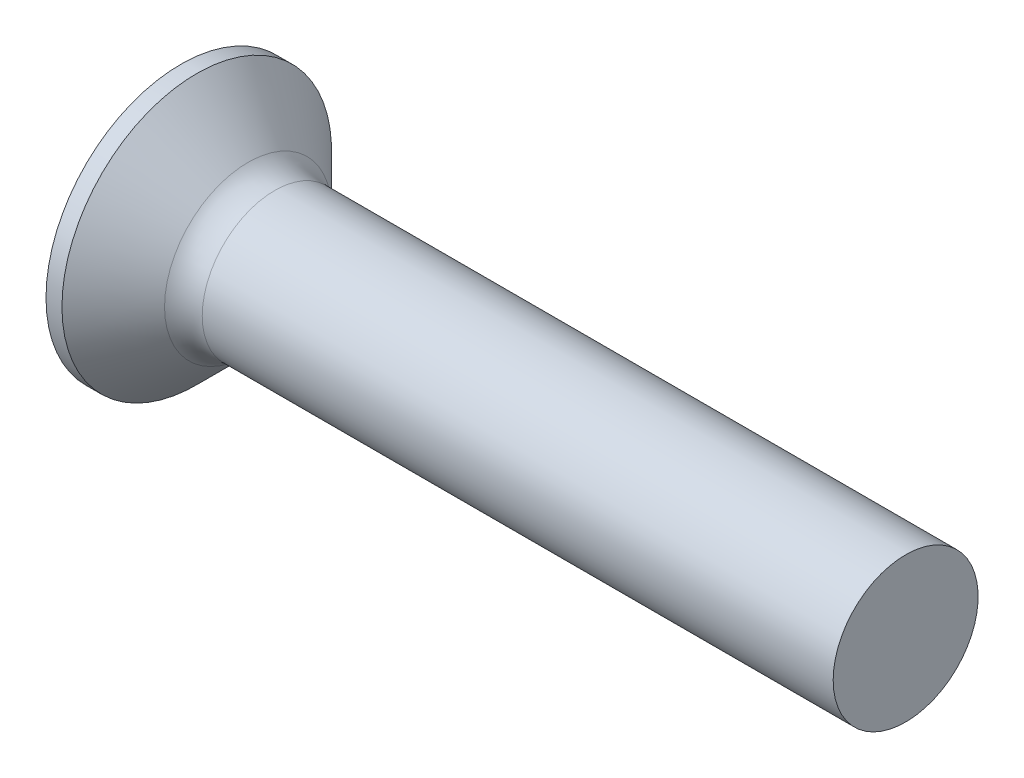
ISO-10303-21;
HEADER;
FILE_DESCRIPTION(('STEP AP214'),'2;1');
FILE_NAME('part.step','',(''),(''),'','','');
FILE_SCHEMA(('AUTOMOTIVE_DESIGN { 1 0 10303 214 1 1 1 1 }'));
ENDSEC;
DATA;
#1=APPLICATION_CONTEXT('core data for automotive mechanical design processes');
#2=APPLICATION_PROTOCOL_DEFINITION('international standard','automotive_design',2000,#1);
#3=PRODUCT_CONTEXT('',#1,'mechanical');
#4=PRODUCT('Part','Part','',(#3));
#5=PRODUCT_RELATED_PRODUCT_CATEGORY('part','',(#4));
#6=PRODUCT_DEFINITION_FORMATION('','',#4);
#7=PRODUCT_DEFINITION_CONTEXT('part definition',#1,'design');
#8=PRODUCT_DEFINITION('design','',#6,#7);
#9=PRODUCT_DEFINITION_SHAPE('','',#8);
#10=(LENGTH_UNIT() NAMED_UNIT(*) SI_UNIT(.MILLI.,.METRE.));
#11=(NAMED_UNIT(*) PLANE_ANGLE_UNIT() SI_UNIT($,.RADIAN.));
#12=(NAMED_UNIT(*) SI_UNIT($,.STERADIAN.) SOLID_ANGLE_UNIT());
#13=UNCERTAINTY_MEASURE_WITH_UNIT(LENGTH_MEASURE(1.E-05),#10,'distance_accuracy_value','');
#14=(GEOMETRIC_REPRESENTATION_CONTEXT(3) GLOBAL_UNCERTAINTY_ASSIGNED_CONTEXT((#13)) GLOBAL_UNIT_ASSIGNED_CONTEXT((#10,
#11,#12)) REPRESENTATION_CONTEXT('',''));
#15=CARTESIAN_POINT('',(0.,0.,0.));
#16=DIRECTION('',(0.,0.,1.));
#17=DIRECTION('',(1.,0.,0.));
#18=AXIS2_PLACEMENT_3D('',#15,#16,#17);
#19=CARTESIAN_POINT('',(3.05,-0.929326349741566,0.515));
#20=DIRECTION('',(0.,0.,-1.));
#21=DIRECTION('',(0.,1.,0.));
#22=AXIS2_PLACEMENT_3D('',#19,#20,#21);
#23=PLANE('',#22);
#24=DIRECTION('',(0.,-1.,0.));
#25=VECTOR('',#24,1.);
#26=CARTESIAN_POINT('',(0.,2.45,0.515));
#27=LINE('',#26,#25);
#28=CARTESIAN_POINT('',(0.,-0.931375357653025,0.515));
#29=VERTEX_POINT('',#28);
#30=CARTESIAN_POINT('',(0.,-2.45,0.515));
#31=VERTEX_POINT('',#30);
#32=EDGE_CURVE('E303',#29,#31,#27,.T.);
#33=ORIENTED_EDGE('',*,*,#32,.F.);
#34=CARTESIAN_POINT('',(-1.54221347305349,-1.05291860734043,0.515));
#35=CARTESIAN_POINT('',(-1.22007147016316,-1.02783607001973,0.515));
#36=CARTESIAN_POINT('',(-0.897941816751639,-1.002592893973,0.515));
#37=CARTESIAN_POINT('',(-0.253713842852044,-0.951673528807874,0.515));
#38=CARTESIAN_POINT('',(0.0683844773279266,-0.925997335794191,0.515));
#39=CARTESIAN_POINT('',(0.712537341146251,-0.874100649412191,0.515));
#40=CARTESIAN_POINT('',(1.03459188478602,-0.847880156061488,0.515));
#41=CARTESIAN_POINT('',(1.67864013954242,-0.794723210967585,0.515));
#42=CARTESIAN_POINT('',(2.0006338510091,-0.767786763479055,0.515));
#43=CARTESIAN_POINT('',(2.56056239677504,-0.720091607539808,0.515));
#44=CARTESIAN_POINT('',(2.7985160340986,-0.699554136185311,0.515));
#45=CARTESIAN_POINT('',(3.27436149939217,-0.657782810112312,0.515));
#46=CARTESIAN_POINT('',(3.51225332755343,-0.636548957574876,0.515));
#47=CARTESIAN_POINT('',(3.98796007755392,-0.59316517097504,0.515));
#48=CARTESIAN_POINT('',(4.22577499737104,-0.571015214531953,0.515));
#49=CARTESIAN_POINT('',(4.70127802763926,-0.525368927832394,0.515));
#50=CARTESIAN_POINT('',(4.93896613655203,-0.50187258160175,0.515000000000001));
#51=CARTESIAN_POINT('',(5.17656597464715,-0.477487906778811,0.515));
#52=B_SPLINE_CURVE_WITH_KNOTS('',3,(#34,#35,#36,#37,#38,#39,#40,#41,#42,#43,#44,#45,#46,#47,#48,
#49,#50,#51),.UNSPECIFIED.,.F.,.F.,(4,2,2,2,2,2,2,2,4),(0.,0.9693512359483,1.9387111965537,
2.90807112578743,3.87742529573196,4.59393929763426,5.3104510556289,6.0269803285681,
6.74351810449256),.UNSPECIFIED.);
#53=CARTESIAN_POINT('',(3.05,-0.677477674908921,0.515));
#54=VERTEX_POINT('',#53);
#55=EDGE_CURVE('E190',#29,#54,#52,.T.);
#56=ORIENTED_EDGE('',*,*,#55,.T.);
#57=DIRECTION('',(0.,-1.,0.));
#58=VECTOR('',#57,1.);
#59=CARTESIAN_POINT('',(3.05,0.929326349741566,0.515));
#60=LINE('',#59,#58);
#61=CARTESIAN_POINT('',(3.05,-0.929326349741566,0.515));
#62=VERTEX_POINT('',#61);
#63=EDGE_CURVE('E327',#54,#62,#60,.T.);
#64=ORIENTED_EDGE('',*,*,#63,.T.);
#65=DIRECTION('',(0.894934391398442,0.446197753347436,0.));
#66=VECTOR('',#65,1.);
#67=CARTESIAN_POINT('',(0.,-2.45,0.515));
#68=LINE('',#67,#66);
#69=EDGE_CURVE('E314',#31,#62,#68,.T.);
#70=ORIENTED_EDGE('',*,*,#69,.F.);
#71=EDGE_LOOP('',(#33,#56,#64,#70));
#72=FACE_BOUND('',#71,.T.);
#73=ADVANCED_FACE('F34',(#72),#23,.T.);
#74=CARTESIAN_POINT('',(3.05,0.929326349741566,0.515));
#75=VERTEX_POINT('',#74);
#76=CARTESIAN_POINT('',(3.05,0.677477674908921,0.515));
#77=VERTEX_POINT('',#76);
#78=EDGE_CURVE('E329',#75,#77,#60,.T.);
#79=ORIENTED_EDGE('',*,*,#78,.T.);
#80=CARTESIAN_POINT('',(-1.54221347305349,1.05291860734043,0.515));
#81=CARTESIAN_POINT('',(-1.22007147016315,1.02783607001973,0.515));
#82=CARTESIAN_POINT('',(-0.897941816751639,1.002592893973,0.515));
#83=CARTESIAN_POINT('',(-0.253713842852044,0.951673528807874,0.515));
#84=CARTESIAN_POINT('',(0.0683844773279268,0.925997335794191,0.515));
#85=CARTESIAN_POINT('',(0.712537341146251,0.874100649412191,0.515));
#86=CARTESIAN_POINT('',(1.03459188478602,0.847880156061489,0.515));
#87=CARTESIAN_POINT('',(1.67864013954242,0.794723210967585,0.515));
#88=CARTESIAN_POINT('',(2.0006338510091,0.767786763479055,0.515));
#89=CARTESIAN_POINT('',(2.56056239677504,0.720091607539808,0.515));
#90=CARTESIAN_POINT('',(2.7985160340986,0.699554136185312,0.515));
#91=CARTESIAN_POINT('',(3.27436149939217,0.657782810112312,0.515));
#92=CARTESIAN_POINT('',(3.51225332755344,0.636548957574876,0.515));
#93=CARTESIAN_POINT('',(3.98796007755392,0.593165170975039,0.515));
#94=CARTESIAN_POINT('',(4.22577499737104,0.571015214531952,0.515));
#95=CARTESIAN_POINT('',(4.70127802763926,0.525368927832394,0.515));
#96=CARTESIAN_POINT('',(4.93896613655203,0.50187258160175,0.515));
#97=CARTESIAN_POINT('',(5.17656597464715,0.477487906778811,0.515));
#98=B_SPLINE_CURVE_WITH_KNOTS('',3,(#80,#81,#82,#83,#84,#85,#86,#87,#88,#89,#90,#91,#92,#93,#94,
#95,#96,#97),.UNSPECIFIED.,.F.,.F.,(4,2,2,2,2,2,2,2,4),(0.,0.9693512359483,1.9387111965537,
2.90807112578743,3.87742529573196,4.59393929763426,5.3104510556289,6.0269803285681,
6.74351810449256),.UNSPECIFIED.);
#99=CARTESIAN_POINT('',(0.,0.931375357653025,0.515));
#100=VERTEX_POINT('',#99);
#101=EDGE_CURVE('E184',#77,#100,#98,.F.);
#102=ORIENTED_EDGE('',*,*,#101,.T.);
#103=CARTESIAN_POINT('',(0.,2.45,0.515));
#104=VERTEX_POINT('',#103);
#105=EDGE_CURVE('E305',#104,#100,#27,.T.);
#106=ORIENTED_EDGE('',*,*,#105,.F.);
#107=DIRECTION('',(0.894934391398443,-0.446197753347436,0.));
#108=VECTOR('',#107,1.);
#109=CARTESIAN_POINT('',(0.,2.45,0.515));
#110=LINE('',#109,#108);
#111=EDGE_CURVE('E62',#104,#75,#110,.T.);
#112=ORIENTED_EDGE('',*,*,#111,.T.);
#113=EDGE_LOOP('',(#79,#102,#106,#112));
#114=FACE_BOUND('',#113,.T.);
#115=ADVANCED_FACE('F166',(#114),#23,.T.);
#116=CARTESIAN_POINT('',(3.05,0.929326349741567,-0.515));
#117=DIRECTION('',(0.,0.,1.));
#118=DIRECTION('',(1.,0.,0.));
#119=AXIS2_PLACEMENT_3D('',#116,#117,#118);
#120=PLANE('',#119);
#121=DIRECTION('',(0.,1.,0.));
#122=VECTOR('',#121,1.);
#123=CARTESIAN_POINT('',(3.05,-0.929326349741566,-0.515));
#124=LINE('',#123,#122);
#125=CARTESIAN_POINT('',(3.05,-0.929326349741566,-0.515));
#126=VERTEX_POINT('',#125);
#127=CARTESIAN_POINT('',(3.05,-0.677477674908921,-0.515));
#128=VERTEX_POINT('',#127);
#129=EDGE_CURVE('E328',#126,#128,#124,.T.);
#130=ORIENTED_EDGE('',*,*,#129,.T.);
#131=CARTESIAN_POINT('',(-1.54221347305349,-1.05291860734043,-0.514999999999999));
#132=CARTESIAN_POINT('',(-1.22007147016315,-1.02783607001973,-0.514999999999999));
#133=CARTESIAN_POINT('',(-0.897941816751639,-1.002592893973,-0.514999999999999));
#134=CARTESIAN_POINT('',(-0.253713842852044,-0.951673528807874,-0.514999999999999));
#135=CARTESIAN_POINT('',(0.0683844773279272,-0.925997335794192,-0.514999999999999));
#136=CARTESIAN_POINT('',(0.712537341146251,-0.874100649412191,-0.515));
#137=CARTESIAN_POINT('',(1.03459188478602,-0.847880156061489,-0.515));
#138=CARTESIAN_POINT('',(1.67864013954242,-0.794723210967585,-0.515));
#139=CARTESIAN_POINT('',(2.0006338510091,-0.767786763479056,-0.515));
#140=CARTESIAN_POINT('',(2.56056239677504,-0.720091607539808,-0.515));
#141=CARTESIAN_POINT('',(2.7985160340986,-0.699554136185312,-0.515));
#142=CARTESIAN_POINT('',(3.27436149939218,-0.657782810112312,-0.515));
#143=CARTESIAN_POINT('',(3.51225332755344,-0.636548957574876,-0.515));
#144=CARTESIAN_POINT('',(3.98796007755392,-0.593165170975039,-0.515));
#145=CARTESIAN_POINT('',(4.22577499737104,-0.571015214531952,-0.515));
#146=CARTESIAN_POINT('',(4.70127802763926,-0.525368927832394,-0.515));
#147=CARTESIAN_POINT('',(4.93896613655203,-0.50187258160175,-0.515));
#148=CARTESIAN_POINT('',(5.17656597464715,-0.477487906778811,-0.515));
#149=B_SPLINE_CURVE_WITH_KNOTS('',3,(#131,#132,#133,#134,#135,#136,#137,#138,#139,#140,#141,
#142,#143,#144,#145,#146,#147,#148),.UNSPECIFIED.,.F.,.F.,(4,2,2,2,2,2,2,2,4),(0.,
0.9693512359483,1.9387111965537,2.90807112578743,3.87742529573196,4.59393929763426,
5.3104510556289,6.0269803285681,6.74351810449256),.UNSPECIFIED.);
#150=CARTESIAN_POINT('',(0.,-0.931375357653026,-0.514999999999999));
#151=VERTEX_POINT('',#150);
#152=EDGE_CURVE('E231',#128,#151,#149,.F.);
#153=ORIENTED_EDGE('',*,*,#152,.T.);
#154=DIRECTION('',(0.,1.,0.));
#155=VECTOR('',#154,1.);
#156=CARTESIAN_POINT('',(0.,-2.45,-0.514999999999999));
#157=LINE('',#156,#155);
#158=CARTESIAN_POINT('',(0.,-2.45,-0.514999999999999));
#159=VERTEX_POINT('',#158);
#160=EDGE_CURVE('E304',#159,#151,#157,.T.);
#161=ORIENTED_EDGE('',*,*,#160,.F.);
#162=DIRECTION('',(0.894934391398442,0.446197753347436,0.));
#163=VECTOR('',#162,1.);
#164=CARTESIAN_POINT('',(0.,-2.45,-0.514999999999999));
#165=LINE('',#164,#163);
#166=EDGE_CURVE('E317',#159,#126,#165,.T.);
#167=ORIENTED_EDGE('',*,*,#166,.T.);
#168=EDGE_LOOP('',(#130,#153,#161,#167));
#169=FACE_BOUND('',#168,.T.);
#170=ADVANCED_FACE('F172',(#169),#120,.T.);
#171=CARTESIAN_POINT('',(0.,0.931375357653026,-0.514999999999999));
#172=VERTEX_POINT('',#171);
#173=CARTESIAN_POINT('',(0.,2.45,-0.514999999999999));
#174=VERTEX_POINT('',#173);
#175=EDGE_CURVE('E313',#172,#174,#157,.T.);
#176=ORIENTED_EDGE('',*,*,#175,.F.);
#177=CARTESIAN_POINT('',(-1.54221347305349,1.05291860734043,-0.514999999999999));
#178=CARTESIAN_POINT('',(-1.22007147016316,1.02783607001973,-0.514999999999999));
#179=CARTESIAN_POINT('',(-0.897941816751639,1.002592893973,-0.514999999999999));
#180=CARTESIAN_POINT('',(-0.253713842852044,0.951673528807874,-0.514999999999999));
#181=CARTESIAN_POINT('',(0.0683844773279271,0.925997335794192,-0.514999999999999));
#182=CARTESIAN_POINT('',(0.712537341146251,0.874100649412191,-0.515));
#183=CARTESIAN_POINT('',(1.03459188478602,0.847880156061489,-0.515));
#184=CARTESIAN_POINT('',(1.67864013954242,0.794723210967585,-0.515));
#185=CARTESIAN_POINT('',(2.0006338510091,0.767786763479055,-0.515));
#186=CARTESIAN_POINT('',(2.56056239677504,0.720091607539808,-0.515));
#187=CARTESIAN_POINT('',(2.7985160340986,0.699554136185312,-0.515));
#188=CARTESIAN_POINT('',(3.27436149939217,0.657782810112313,-0.515));
#189=CARTESIAN_POINT('',(3.51225332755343,0.636548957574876,-0.515));
#190=CARTESIAN_POINT('',(3.98796007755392,0.59316517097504,-0.515));
#191=CARTESIAN_POINT('',(4.22577499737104,0.571015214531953,-0.515));
#192=CARTESIAN_POINT('',(4.70127802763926,0.525368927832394,-0.515));
#193=CARTESIAN_POINT('',(4.93896613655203,0.50187258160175,-0.515));
#194=CARTESIAN_POINT('',(5.17656597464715,0.477487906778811,-0.515));
#195=B_SPLINE_CURVE_WITH_KNOTS('',3,(#177,#178,#179,#180,#181,#182,#183,#184,#185,#186,#187,
#188,#189,#190,#191,#192,#193,#194),.UNSPECIFIED.,.F.,.F.,(4,2,2,2,2,2,2,2,4),(0.,
0.9693512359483,1.9387111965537,2.90807112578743,3.87742529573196,4.59393929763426,
5.3104510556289,6.0269803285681,6.74351810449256),.UNSPECIFIED.);
#196=CARTESIAN_POINT('',(3.05,0.677477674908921,-0.515));
#197=VERTEX_POINT('',#196);
#198=EDGE_CURVE('E227',#172,#197,#195,.T.);
#199=ORIENTED_EDGE('',*,*,#198,.T.);
#200=CARTESIAN_POINT('',(3.05,0.929326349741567,-0.515));
#201=VERTEX_POINT('',#200);
#202=EDGE_CURVE('E334',#197,#201,#124,.T.);
#203=ORIENTED_EDGE('',*,*,#202,.T.);
#204=DIRECTION('',(0.894934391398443,-0.446197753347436,0.));
#205=VECTOR('',#204,1.);
#206=CARTESIAN_POINT('',(0.,2.45,-0.514999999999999));
#207=LINE('',#206,#205);
#208=EDGE_CURVE('E321',#174,#201,#207,.T.);
#209=ORIENTED_EDGE('',*,*,#208,.F.);
#210=EDGE_LOOP('',(#176,#199,#203,#209));
#211=FACE_BOUND('',#210,.T.);
#212=ADVANCED_FACE('F452',(#211),#120,.T.);
#213=CARTESIAN_POINT('',(3.05,-0.929326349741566,-0.515));
#214=DIRECTION('',(-1.,0.,0.));
#215=DIRECTION('',(0.,0.,1.));
#216=AXIS2_PLACEMENT_3D('',#213,#214,#215);
#217=PLANE('',#216);
#218=ORIENTED_EDGE('',*,*,#63,.F.);
#219=CARTESIAN_POINT('',(3.05,0.,0.));
#220=DIRECTION('',(-1.,0.,0.));
#221=DIRECTION('',(0.,0.,1.));
#222=AXIS2_PLACEMENT_3D('',#219,#220,#221);
#223=CIRCLE('',#222,0.850999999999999);
#224=EDGE_CURVE('E274',#128,#54,#223,.T.);
#225=ORIENTED_EDGE('',*,*,#224,.F.);
#226=ORIENTED_EDGE('',*,*,#129,.F.);
#227=DIRECTION('',(0.,0.,-1.));
#228=VECTOR('',#227,1.);
#229=CARTESIAN_POINT('',(3.05,-0.929326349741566,0.515));
#230=LINE('',#229,#228);
#231=EDGE_CURVE('E324',#62,#126,#230,.T.);
#232=ORIENTED_EDGE('',*,*,#231,.F.);
#233=EDGE_LOOP('',(#218,#225,#226,#232));
#234=FACE_BOUND('',#233,.T.);
#235=ADVANCED_FACE('F445',(#234),#217,.T.);
#236=DIRECTION('',(0.,0.,-1.));
#237=VECTOR('',#236,1.);
#238=CARTESIAN_POINT('',(3.05,-0.515000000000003,0.929326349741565));
#239=LINE('',#238,#237);
#240=CARTESIAN_POINT('',(3.05,-0.514999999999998,-0.677477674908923));
#241=VERTEX_POINT('',#240);
#242=CARTESIAN_POINT('',(3.05,-0.514999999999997,-0.929326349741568));
#243=VERTEX_POINT('',#242);
#244=EDGE_CURVE('E289',#241,#243,#239,.T.);
#245=ORIENTED_EDGE('',*,*,#244,.F.);
#246=CARTESIAN_POINT('',(3.05,0.515000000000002,-0.677477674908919));
#247=VERTEX_POINT('',#246);
#248=EDGE_CURVE('E279',#247,#241,#223,.T.);
#249=ORIENTED_EDGE('',*,*,#248,.F.);
#250=DIRECTION('',(0.,0.,1.));
#251=VECTOR('',#250,1.);
#252=CARTESIAN_POINT('',(3.05,0.515000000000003,-0.929326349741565));
#253=LINE('',#252,#251);
#254=CARTESIAN_POINT('',(3.05,0.515000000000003,-0.929326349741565));
#255=VERTEX_POINT('',#254);
#256=EDGE_CURVE('E287',#255,#247,#253,.T.);
#257=ORIENTED_EDGE('',*,*,#256,.F.);
#258=DIRECTION('',(0.,1.,0.));
#259=VECTOR('',#258,1.);
#260=CARTESIAN_POINT('',(3.05,-0.514999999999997,-0.929326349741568));
#261=LINE('',#260,#259);
#262=EDGE_CURVE('E298',#243,#255,#261,.T.);
#263=ORIENTED_EDGE('',*,*,#262,.F.);
#264=EDGE_LOOP('',(#245,#249,#257,#263));
#265=FACE_BOUND('',#264,.T.);
#266=ADVANCED_FACE('F285',(#265),#217,.T.);
#267=ORIENTED_EDGE('',*,*,#202,.F.);
#268=EDGE_CURVE('E266',#77,#197,#223,.T.);
#269=ORIENTED_EDGE('',*,*,#268,.F.);
#270=ORIENTED_EDGE('',*,*,#78,.F.);
#271=DIRECTION('',(0.,0.,1.));
#272=VECTOR('',#271,1.);
#273=CARTESIAN_POINT('',(3.05,0.929326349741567,-0.515));
#274=LINE('',#273,#272);
#275=EDGE_CURVE('E325',#201,#75,#274,.T.);
#276=ORIENTED_EDGE('',*,*,#275,.F.);
#277=EDGE_LOOP('',(#267,#269,#270,#276));
#278=FACE_BOUND('',#277,.T.);
#279=ADVANCED_FACE('F425',(#278),#217,.T.);
#280=CARTESIAN_POINT('',(3.05,-0.514999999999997,-0.929326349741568));
#281=DIRECTION('',(0.,1.,0.));
#282=DIRECTION('',(0.,0.,1.));
#283=AXIS2_PLACEMENT_3D('',#280,#281,#282);
#284=PLANE('',#283);
#285=DIRECTION('',(0.,0.,-1.));
#286=VECTOR('',#285,1.);
#287=CARTESIAN_POINT('',(0.,-0.515000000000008,2.45));
#288=LINE('',#287,#286);
#289=CARTESIAN_POINT('',(0.,-0.514999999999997,-0.931375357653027));
#290=VERTEX_POINT('',#289);
#291=CARTESIAN_POINT('',(0.,-0.514999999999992,-2.45));
#292=VERTEX_POINT('',#291);
#293=EDGE_CURVE('E378',#290,#292,#288,.T.);
#294=ORIENTED_EDGE('',*,*,#293,.F.);
#295=CARTESIAN_POINT('',(-1.54221347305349,-0.514999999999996,-1.05291860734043));
#296=CARTESIAN_POINT('',(-1.22007147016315,-0.514999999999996,-1.02783607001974));
#297=CARTESIAN_POINT('',(-0.897941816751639,-0.514999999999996,-1.002592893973));
#298=CARTESIAN_POINT('',(-0.253713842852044,-0.514999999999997,-0.951673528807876));
#299=CARTESIAN_POINT('',(0.0683844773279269,-0.514999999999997,-0.925997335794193));
#300=CARTESIAN_POINT('',(0.712537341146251,-0.514999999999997,-0.874100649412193));
#301=CARTESIAN_POINT('',(1.03459188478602,-0.514999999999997,-0.84788015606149));
#302=CARTESIAN_POINT('',(1.67864013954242,-0.514999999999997,-0.794723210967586));
#303=CARTESIAN_POINT('',(2.0006338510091,-0.514999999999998,-0.767786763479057));
#304=CARTESIAN_POINT('',(2.56056239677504,-0.514999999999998,-0.72009160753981));
#305=CARTESIAN_POINT('',(2.7985160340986,-0.514999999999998,-0.699554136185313));
#306=CARTESIAN_POINT('',(3.27436149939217,-0.514999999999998,-0.657782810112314));
#307=CARTESIAN_POINT('',(3.51225332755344,-0.514999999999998,-0.636548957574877));
#308=CARTESIAN_POINT('',(3.98796007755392,-0.514999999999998,-0.593165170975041));
#309=CARTESIAN_POINT('',(4.22577499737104,-0.514999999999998,-0.571015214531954));
#310=CARTESIAN_POINT('',(4.70127802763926,-0.514999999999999,-0.525368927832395));
#311=CARTESIAN_POINT('',(4.93896613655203,-0.514999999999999,-0.501872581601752));
#312=CARTESIAN_POINT('',(5.17656597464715,-0.514999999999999,-0.477487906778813));
#313=B_SPLINE_CURVE_WITH_KNOTS('',3,(#295,#296,#297,#298,#299,#300,#301,#302,#303,#304,#305,
#306,#307,#308,#309,#310,#311,#312),.UNSPECIFIED.,.F.,.F.,(4,2,2,2,2,2,2,2,4),(0.,
0.9693512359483,1.9387111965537,2.90807112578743,3.87742529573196,4.59393929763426,
5.3104510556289,6.0269803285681,6.74351810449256),.UNSPECIFIED.);
#314=EDGE_CURVE('E221',#290,#241,#313,.T.);
#315=ORIENTED_EDGE('',*,*,#314,.T.);
#316=ORIENTED_EDGE('',*,*,#244,.T.);
#317=DIRECTION('',(0.894934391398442,0.,0.446197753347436));
#318=VECTOR('',#317,1.);
#319=CARTESIAN_POINT('',(0.,-0.514999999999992,-2.45));
#320=LINE('',#319,#318);
#321=EDGE_CURVE('E385',#292,#243,#320,.T.);
#322=ORIENTED_EDGE('',*,*,#321,.F.);
#323=EDGE_LOOP('',(#294,#315,#316,#322));
#324=FACE_BOUND('',#323,.T.);
#325=ADVANCED_FACE('F396',(#324),#284,.T.);
#326=CARTESIAN_POINT('',(3.05,0.514999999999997,0.929326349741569));
#327=DIRECTION('',(0.,-1.,0.));
#328=DIRECTION('',(1.,0.,0.));
#329=AXIS2_PLACEMENT_3D('',#326,#327,#328);
#330=PLANE('',#329);
#331=ORIENTED_EDGE('',*,*,#256,.T.);
#332=CARTESIAN_POINT('',(-1.54221347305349,0.515000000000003,-1.05291860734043));
#333=CARTESIAN_POINT('',(-1.22007147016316,0.515000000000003,-1.02783607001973));
#334=CARTESIAN_POINT('',(-0.897941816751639,0.515000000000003,-1.002592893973));
#335=CARTESIAN_POINT('',(-0.253713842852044,0.515000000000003,-0.951673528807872));
#336=CARTESIAN_POINT('',(0.0683844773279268,0.515000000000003,-0.92599733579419));
#337=CARTESIAN_POINT('',(0.712537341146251,0.515000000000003,-0.874100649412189));
#338=CARTESIAN_POINT('',(1.03459188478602,0.515000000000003,-0.847880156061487));
#339=CARTESIAN_POINT('',(1.67864013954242,0.515000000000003,-0.794723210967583));
#340=CARTESIAN_POINT('',(2.0006338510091,0.515000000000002,-0.767786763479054));
#341=CARTESIAN_POINT('',(2.56056239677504,0.515000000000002,-0.720091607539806));
#342=CARTESIAN_POINT('',(2.7985160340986,0.515000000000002,-0.69955413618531));
#343=CARTESIAN_POINT('',(3.27436149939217,0.515000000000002,-0.657782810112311));
#344=CARTESIAN_POINT('',(3.51225332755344,0.515000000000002,-0.636548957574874));
#345=CARTESIAN_POINT('',(3.98796007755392,0.515000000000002,-0.593165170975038));
#346=CARTESIAN_POINT('',(4.22577499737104,0.515000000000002,-0.571015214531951));
#347=CARTESIAN_POINT('',(4.70127802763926,0.515000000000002,-0.525368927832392));
#348=CARTESIAN_POINT('',(4.93896613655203,0.515000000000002,-0.501872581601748));
#349=CARTESIAN_POINT('',(5.17656597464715,0.515000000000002,-0.47748790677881));
#350=B_SPLINE_CURVE_WITH_KNOTS('',3,(#332,#333,#334,#335,#336,#337,#338,#339,#340,#341,#342,
#343,#344,#345,#346,#347,#348,#349),.UNSPECIFIED.,.F.,.F.,(4,2,2,2,2,2,2,2,4),(0.,
0.9693512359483,1.9387111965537,2.90807112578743,3.87742529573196,4.59393929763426,
5.3104510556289,6.0269803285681,6.74351810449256),.UNSPECIFIED.);
#351=CARTESIAN_POINT('',(0.,0.515000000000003,-0.931375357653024));
#352=VERTEX_POINT('',#351);
#353=EDGE_CURVE('E215',#247,#352,#350,.F.);
#354=ORIENTED_EDGE('',*,*,#353,.T.);
#355=DIRECTION('',(0.,0.,1.));
#356=VECTOR('',#355,1.);
#357=CARTESIAN_POINT('',(0.,0.515000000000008,-2.45));
#358=LINE('',#357,#356);
#359=CARTESIAN_POINT('',(0.,0.515000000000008,-2.45));
#360=VERTEX_POINT('',#359);
#361=EDGE_CURVE('E382',#360,#352,#358,.T.);
#362=ORIENTED_EDGE('',*,*,#361,.F.);
#363=DIRECTION('',(0.894934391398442,0.,0.446197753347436));
#364=VECTOR('',#363,1.);
#365=CARTESIAN_POINT('',(0.,0.515000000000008,-2.45));
#366=LINE('',#365,#364);
#367=EDGE_CURVE('E291',#360,#255,#366,.T.);
#368=ORIENTED_EDGE('',*,*,#367,.T.);
#369=EDGE_LOOP('',(#331,#354,#362,#368));
#370=FACE_BOUND('',#369,.T.);
#371=ADVANCED_FACE('F290',(#370),#330,.T.);
#372=CARTESIAN_POINT('',(3.05,-0.515000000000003,0.929326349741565));
#373=VERTEX_POINT('',#372);
#374=CARTESIAN_POINT('',(3.05,-0.515000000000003,0.677477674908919));
#375=VERTEX_POINT('',#374);
#376=EDGE_CURVE('E393',#373,#375,#239,.T.);
#377=ORIENTED_EDGE('',*,*,#376,.T.);
#378=CARTESIAN_POINT('',(-1.54221347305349,-0.515000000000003,1.05291860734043));
#379=CARTESIAN_POINT('',(-1.22007147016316,-0.515000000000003,1.02783607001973));
#380=CARTESIAN_POINT('',(-0.897941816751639,-0.515000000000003,1.002592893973));
#381=CARTESIAN_POINT('',(-0.253713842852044,-0.515000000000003,0.951673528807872));
#382=CARTESIAN_POINT('',(0.0683844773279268,-0.515000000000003,0.92599733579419));
#383=CARTESIAN_POINT('',(0.712537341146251,-0.515000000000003,0.874100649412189));
#384=CARTESIAN_POINT('',(1.03459188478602,-0.515000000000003,0.847880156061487));
#385=CARTESIAN_POINT('',(1.67864013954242,-0.515000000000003,0.794723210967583));
#386=CARTESIAN_POINT('',(2.0006338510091,-0.515000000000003,0.767786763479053));
#387=CARTESIAN_POINT('',(2.56056239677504,-0.515000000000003,0.720091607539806));
#388=CARTESIAN_POINT('',(2.7985160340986,-0.515000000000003,0.69955413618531));
#389=CARTESIAN_POINT('',(3.27436149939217,-0.515000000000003,0.657782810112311));
#390=CARTESIAN_POINT('',(3.51225332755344,-0.515000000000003,0.636548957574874));
#391=CARTESIAN_POINT('',(3.98796007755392,-0.515000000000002,0.593165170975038));
#392=CARTESIAN_POINT('',(4.22577499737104,-0.515000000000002,0.571015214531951));
#393=CARTESIAN_POINT('',(4.70127802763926,-0.515000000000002,0.525368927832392));
#394=CARTESIAN_POINT('',(4.93896613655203,-0.515000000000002,0.501872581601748));
#395=CARTESIAN_POINT('',(5.17656597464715,-0.515000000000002,0.47748790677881));
#396=B_SPLINE_CURVE_WITH_KNOTS('',3,(#378,#379,#380,#381,#382,#383,#384,#385,#386,#387,#388,
#389,#390,#391,#392,#393,#394,#395),.UNSPECIFIED.,.F.,.F.,(4,2,2,2,2,2,2,2,4),(0.,
0.9693512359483,1.9387111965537,2.90807112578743,3.87742529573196,4.59393929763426,
5.3104510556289,6.0269803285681,6.74351810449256),.UNSPECIFIED.);
#397=CARTESIAN_POINT('',(0.,-0.515000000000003,0.931375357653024));
#398=VERTEX_POINT('',#397);
#399=EDGE_CURVE('E208',#375,#398,#396,.F.);
#400=ORIENTED_EDGE('',*,*,#399,.T.);
#401=CARTESIAN_POINT('',(0.,-0.515000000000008,2.45));
#402=VERTEX_POINT('',#401);
#403=EDGE_CURVE('E374',#402,#398,#288,.T.);
#404=ORIENTED_EDGE('',*,*,#403,.F.);
#405=DIRECTION('',(0.894934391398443,0.,-0.446197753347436));
#406=VECTOR('',#405,1.);
#407=CARTESIAN_POINT('',(0.,-0.515000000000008,2.45));
#408=LINE('',#407,#406);
#409=EDGE_CURVE('E389',#402,#373,#408,.T.);
#410=ORIENTED_EDGE('',*,*,#409,.T.);
#411=EDGE_LOOP('',(#377,#400,#404,#410));
#412=FACE_BOUND('',#411,.T.);
#413=ADVANCED_FACE('F421',(#412),#284,.T.);
#414=CARTESIAN_POINT('',(0.,0.514999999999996,0.931375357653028));
#415=VERTEX_POINT('',#414);
#416=CARTESIAN_POINT('',(0.,0.514999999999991,2.45));
#417=VERTEX_POINT('',#416);
#418=EDGE_CURVE('E384',#415,#417,#358,.T.);
#419=ORIENTED_EDGE('',*,*,#418,.F.);
#420=CARTESIAN_POINT('',(-1.54221347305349,0.514999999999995,1.05291860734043));
#421=CARTESIAN_POINT('',(-1.22007147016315,0.514999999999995,1.02783607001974));
#422=CARTESIAN_POINT('',(-0.897941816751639,0.514999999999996,1.002592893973));
#423=CARTESIAN_POINT('',(-0.253713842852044,0.514999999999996,0.951673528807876));
#424=CARTESIAN_POINT('',(0.0683844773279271,0.514999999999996,0.925997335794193));
#425=CARTESIAN_POINT('',(0.712537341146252,0.514999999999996,0.874100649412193));
#426=CARTESIAN_POINT('',(1.03459188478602,0.514999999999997,0.84788015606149));
#427=CARTESIAN_POINT('',(1.67864013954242,0.514999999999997,0.794723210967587));
#428=CARTESIAN_POINT('',(2.0006338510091,0.514999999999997,0.767786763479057));
#429=CARTESIAN_POINT('',(2.56056239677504,0.514999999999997,0.72009160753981));
#430=CARTESIAN_POINT('',(2.7985160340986,0.514999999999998,0.699554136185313));
#431=CARTESIAN_POINT('',(3.27436149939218,0.514999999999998,0.657782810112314));
#432=CARTESIAN_POINT('',(3.51225332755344,0.514999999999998,0.636548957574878));
#433=CARTESIAN_POINT('',(3.98796007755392,0.514999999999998,0.593165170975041));
#434=CARTESIAN_POINT('',(4.22577499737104,0.514999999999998,0.571015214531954));
#435=CARTESIAN_POINT('',(4.70127802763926,0.514999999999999,0.525368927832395));
#436=CARTESIAN_POINT('',(4.93896613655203,0.514999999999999,0.501872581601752));
#437=CARTESIAN_POINT('',(5.17656597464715,0.514999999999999,0.477487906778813));
#438=B_SPLINE_CURVE_WITH_KNOTS('',3,(#420,#421,#422,#423,#424,#425,#426,#427,#428,#429,#430,
#431,#432,#433,#434,#435,#436,#437),.UNSPECIFIED.,.F.,.F.,(4,2,2,2,2,2,2,2,4),(0.,
0.9693512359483,1.9387111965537,2.90807112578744,3.87742529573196,4.59393929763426,
5.3104510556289,6.0269803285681,6.74351810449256),.UNSPECIFIED.);
#439=CARTESIAN_POINT('',(3.05,0.514999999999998,0.677477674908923));
#440=VERTEX_POINT('',#439);
#441=EDGE_CURVE('E11',#415,#440,#438,.T.);
#442=ORIENTED_EDGE('',*,*,#441,.T.);
#443=CARTESIAN_POINT('',(3.05,0.514999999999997,0.929326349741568));
#444=VERTEX_POINT('',#443);
#445=EDGE_CURVE('E196',#440,#444,#253,.T.);
#446=ORIENTED_EDGE('',*,*,#445,.T.);
#447=DIRECTION('',(0.894934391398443,0.,-0.446197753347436));
#448=VECTOR('',#447,1.);
#449=CARTESIAN_POINT('',(0.,0.514999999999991,2.45));
#450=LINE('',#449,#448);
#451=EDGE_CURVE('E391',#417,#444,#450,.T.);
#452=ORIENTED_EDGE('',*,*,#451,.F.);
#453=EDGE_LOOP('',(#419,#442,#446,#452));
#454=FACE_BOUND('',#453,.T.);
#455=ADVANCED_FACE('F372',(#454),#330,.T.);
#456=CARTESIAN_POINT('',(0.,0.,0.));
#457=DIRECTION('',(-1.,0.,0.));
#458=DIRECTION('',(0.,0.,1.));
#459=AXIS2_PLACEMENT_3D('',#456,#457,#458);
#460=PLANE('',#459);
#461=CARTESIAN_POINT('',(0.,0.,0.));
#462=DIRECTION('',(-1.,0.,0.));
#463=DIRECTION('',(0.,0.,1.));
#464=AXIS2_PLACEMENT_3D('',#461,#462,#463);
#465=CIRCLE('',#464,4.65);
#466=CARTESIAN_POINT('',(0.,0.,4.65));
#467=VERTEX_POINT('',#466);
#468=EDGE_CURVE('E340',#467,#467,#465,.T.);
#469=ORIENTED_EDGE('',*,*,#468,.T.);
#470=EDGE_LOOP('',(#469));
#471=FACE_BOUND('',#470,.T.);
#472=ORIENTED_EDGE('',*,*,#403,.T.);
#473=CARTESIAN_POINT('',(0.,0.,0.));
#474=DIRECTION('',(-1.,0.,0.));
#475=DIRECTION('',(0.,0.,1.));
#476=AXIS2_PLACEMENT_3D('',#473,#474,#475);
#477=CIRCLE('',#476,1.06427677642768);
#478=EDGE_CURVE('E260',#29,#398,#477,.T.);
#479=ORIENTED_EDGE('',*,*,#478,.F.);
#480=ORIENTED_EDGE('',*,*,#32,.T.);
#481=DIRECTION('',(0.,0.,-1.));
#482=VECTOR('',#481,1.);
#483=CARTESIAN_POINT('',(0.,-2.45,0.515));
#484=LINE('',#483,#482);
#485=EDGE_CURVE('E308',#31,#159,#484,.T.);
#486=ORIENTED_EDGE('',*,*,#485,.T.);
#487=ORIENTED_EDGE('',*,*,#160,.T.);
#488=EDGE_CURVE('E262',#290,#151,#477,.T.);
#489=ORIENTED_EDGE('',*,*,#488,.F.);
#490=ORIENTED_EDGE('',*,*,#293,.T.);
#491=DIRECTION('',(0.,1.,0.));
#492=VECTOR('',#491,1.);
#493=CARTESIAN_POINT('',(0.,-0.514999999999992,-2.45));
#494=LINE('',#493,#492);
#495=EDGE_CURVE('E377',#292,#360,#494,.T.);
#496=ORIENTED_EDGE('',*,*,#495,.T.);
#497=ORIENTED_EDGE('',*,*,#361,.T.);
#498=EDGE_CURVE('E259',#172,#352,#477,.T.);
#499=ORIENTED_EDGE('',*,*,#498,.F.);
#500=ORIENTED_EDGE('',*,*,#175,.T.);
#501=DIRECTION('',(0.,0.,1.));
#502=VECTOR('',#501,1.);
#503=CARTESIAN_POINT('',(0.,2.45,-0.514999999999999));
#504=LINE('',#503,#502);
#505=EDGE_CURVE('E300',#174,#104,#504,.T.);
#506=ORIENTED_EDGE('',*,*,#505,.T.);
#507=ORIENTED_EDGE('',*,*,#105,.T.);
#508=EDGE_CURVE('E255',#415,#100,#477,.T.);
#509=ORIENTED_EDGE('',*,*,#508,.F.);
#510=ORIENTED_EDGE('',*,*,#418,.T.);
#511=DIRECTION('',(0.,-1.,0.));
#512=VECTOR('',#511,1.);
#513=CARTESIAN_POINT('',(0.,0.514999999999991,2.45));
#514=LINE('',#513,#512);
#515=EDGE_CURVE('E197',#417,#402,#514,.T.);
#516=ORIENTED_EDGE('',*,*,#515,.T.);
#517=EDGE_LOOP('',(#472,#479,#480,#486,#487,#489,#490,#496,#497,#499,#500,#506,#507,#509,#510,#516));
#518=FACE_BOUND('',#517,.T.);
#519=ADVANCED_FACE('F366',(#471,#518),#460,.T.);
#520=CARTESIAN_POINT('',(-6.34999999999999,0.,0.));
#521=DIRECTION('',(-1.,0.,0.));
#522=DIRECTION('',(0.,0.,1.));
#523=AXIS2_PLACEMENT_3D('',#520,#521,#522);
#524=CYLINDRICAL_SURFACE('',#523,4.65);
#525=CARTESIAN_POINT('',(0.550000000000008,0.,0.));
#526=DIRECTION('',(-1.,0.,0.));
#527=DIRECTION('',(0.,0.,1.));
#528=AXIS2_PLACEMENT_3D('',#525,#526,#527);
#529=CIRCLE('',#528,4.65);
#530=CARTESIAN_POINT('',(0.550000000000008,0.,4.65));
#531=VERTEX_POINT('',#530);
#532=EDGE_CURVE('E337',#531,#531,#529,.T.);
#533=ORIENTED_EDGE('',*,*,#532,.T.);
#534=EDGE_LOOP('',(#533));
#535=FACE_BOUND('',#534,.T.);
#536=ORIENTED_EDGE('',*,*,#468,.F.);
#537=EDGE_LOOP('',(#536));
#538=FACE_BOUND('',#537,.T.);
#539=ADVANCED_FACE('F360',(#535,#538),#524,.T.);
#540=CARTESIAN_POINT('',(0.550000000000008,0.,0.));
#541=DIRECTION('',(-1.,0.,0.));
#542=DIRECTION('',(0.,0.,1.));
#543=AXIS2_PLACEMENT_3D('',#540,#541,#542);
#544=CONICAL_SURFACE('',#543,4.65,0.78539816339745);
#545=CARTESIAN_POINT('',(2.31923881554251,0.,0.));
#546=DIRECTION('',(-1.,0.,0.));
#547=DIRECTION('',(0.,0.,1.));
#548=AXIS2_PLACEMENT_3D('',#545,#546,#547);
#549=CIRCLE('',#548,2.88076118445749);
#550=CARTESIAN_POINT('',(2.31923881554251,0.,2.88076118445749));
#551=VERTEX_POINT('',#550);
#552=EDGE_CURVE('E343',#551,#551,#549,.T.);
#553=ORIENTED_EDGE('',*,*,#552,.T.);
#554=EDGE_LOOP('',(#553));
#555=FACE_BOUND('',#554,.T.);
#556=ORIENTED_EDGE('',*,*,#532,.F.);
#557=EDGE_LOOP('',(#556));
#558=FACE_BOUND('',#557,.T.);
#559=ADVANCED_FACE('F357',(#555,#558),#544,.T.);
#560=CARTESIAN_POINT('',(-6.34999999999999,0.,0.));
#561=DIRECTION('',(-1.,0.,0.));
#562=DIRECTION('',(0.,0.,1.));
#563=AXIS2_PLACEMENT_3D('',#560,#561,#562);
#564=CYLINDRICAL_SURFACE('',#563,2.5);
#565=CARTESIAN_POINT('',(3.23847763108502,0.,0.));
#566=DIRECTION('',(-1.,0.,0.));
#567=DIRECTION('',(0.,0.,1.));
#568=AXIS2_PLACEMENT_3D('',#565,#566,#567);
#569=CIRCLE('',#568,2.5);
#570=CARTESIAN_POINT('',(3.23847763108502,0.,2.5));
#571=VERTEX_POINT('',#570);
#572=EDGE_CURVE('E47',#571,#571,#569,.F.);
#573=ORIENTED_EDGE('',*,*,#572,.T.);
#574=EDGE_LOOP('',(#573));
#575=FACE_BOUND('',#574,.T.);
#576=CARTESIAN_POINT('',(25.,0.,0.));
#577=DIRECTION('',(-1.,0.,0.));
#578=DIRECTION('',(0.,0.,1.));
#579=AXIS2_PLACEMENT_3D('',#576,#577,#578);
#580=CIRCLE('',#579,2.5);
#581=CARTESIAN_POINT('',(25.,0.,2.5));
#582=VERTEX_POINT('',#581);
#583=EDGE_CURVE('E311',#582,#582,#580,.T.);
#584=ORIENTED_EDGE('',*,*,#583,.T.);
#585=EDGE_LOOP('',(#584));
#586=FACE_BOUND('',#585,.T.);
#587=ADVANCED_FACE('F348',(#575,#586),#564,.T.);
#588=CARTESIAN_POINT('',(25.,2.5,0.));
#589=DIRECTION('',(1.,0.,0.));
#590=DIRECTION('',(0.,0.,-1.));
#591=AXIS2_PLACEMENT_3D('',#588,#589,#590);
#592=PLANE('',#591);
#593=ORIENTED_EDGE('',*,*,#583,.F.);
#594=EDGE_LOOP('',(#593));
#595=FACE_BOUND('',#594,.T.);
#596=ADVANCED_FACE('F354',(#595),#592,.T.);
#597=CARTESIAN_POINT('',(3.23847763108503,0.,0.));
#598=DIRECTION('',(-1.,0.,0.));
#599=DIRECTION('',(0.,0.,1.));
#600=AXIS2_PLACEMENT_3D('',#597,#598,#599);
#601=TOROIDAL_SURFACE('',#600,3.8,1.3);
#602=ORIENTED_EDGE('',*,*,#572,.F.);
#603=EDGE_LOOP('',(#602));
#604=FACE_BOUND('',#603,.T.);
#605=ORIENTED_EDGE('',*,*,#552,.F.);
#606=EDGE_LOOP('',(#605));
#607=FACE_BOUND('',#606,.T.);
#608=ADVANCED_FACE('F36',(#604,#607),#601,.F.);
#609=ORIENTED_EDGE('',*,*,#445,.F.);
#610=EDGE_CURVE('E267',#375,#440,#223,.T.);
#611=ORIENTED_EDGE('',*,*,#610,.F.);
#612=ORIENTED_EDGE('',*,*,#376,.F.);
#613=DIRECTION('',(0.,-1.,0.));
#614=VECTOR('',#613,1.);
#615=CARTESIAN_POINT('',(3.05,0.514999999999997,0.929326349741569));
#616=LINE('',#615,#614);
#617=EDGE_CURVE('E292',#444,#373,#616,.T.);
#618=ORIENTED_EDGE('',*,*,#617,.F.);
#619=EDGE_LOOP('',(#609,#611,#612,#618));
#620=FACE_BOUND('',#619,.T.);
#621=ADVANCED_FACE('F353',(#620),#217,.T.);
#622=CARTESIAN_POINT('',(3.05,-0.929326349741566,-0.515));
#623=DIRECTION('',(-0.446197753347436,0.894934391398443,0.));
#624=DIRECTION('',(-0.894934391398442,-0.446197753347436,0.));
#625=AXIS2_PLACEMENT_3D('',#622,#623,#624);
#626=PLANE('',#625);
#627=ORIENTED_EDGE('',*,*,#166,.F.);
#628=ORIENTED_EDGE('',*,*,#485,.F.);
#629=ORIENTED_EDGE('',*,*,#69,.T.);
#630=ORIENTED_EDGE('',*,*,#231,.T.);
#631=EDGE_LOOP('',(#627,#628,#629,#630));
#632=FACE_BOUND('',#631,.T.);
#633=ADVANCED_FACE('F178',(#632),#626,.T.);
#634=CARTESIAN_POINT('',(3.05,0.929326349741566,0.515));
#635=DIRECTION('',(-0.446197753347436,-0.894934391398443,0.));
#636=DIRECTION('',(0.894934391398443,-0.446197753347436,0.));
#637=AXIS2_PLACEMENT_3D('',#634,#635,#636);
#638=PLANE('',#637);
#639=ORIENTED_EDGE('',*,*,#111,.F.);
#640=ORIENTED_EDGE('',*,*,#505,.F.);
#641=ORIENTED_EDGE('',*,*,#208,.T.);
#642=ORIENTED_EDGE('',*,*,#275,.T.);
#643=EDGE_LOOP('',(#639,#640,#641,#642));
#644=FACE_BOUND('',#643,.T.);
#645=ADVANCED_FACE('F418',(#644),#638,.T.);
#646=CARTESIAN_POINT('',(3.05,0.515000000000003,-0.929326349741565));
#647=DIRECTION('',(-0.446197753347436,0.,0.894934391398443));
#648=DIRECTION('',(-0.894934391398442,0.,-0.446197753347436));
#649=AXIS2_PLACEMENT_3D('',#646,#647,#648);
#650=PLANE('',#649);
#651=ORIENTED_EDGE('',*,*,#367,.F.);
#652=ORIENTED_EDGE('',*,*,#495,.F.);
#653=ORIENTED_EDGE('',*,*,#321,.T.);
#654=ORIENTED_EDGE('',*,*,#262,.T.);
#655=EDGE_LOOP('',(#651,#652,#653,#654));
#656=FACE_BOUND('',#655,.T.);
#657=ADVANCED_FACE('F201',(#656),#650,.T.);
#658=CARTESIAN_POINT('',(3.05,-0.515000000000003,0.929326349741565));
#659=DIRECTION('',(-0.446197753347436,0.,-0.894934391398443));
#660=DIRECTION('',(0.894934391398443,0.,-0.446197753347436));
#661=AXIS2_PLACEMENT_3D('',#658,#659,#660);
#662=PLANE('',#661);
#663=ORIENTED_EDGE('',*,*,#409,.F.);
#664=ORIENTED_EDGE('',*,*,#515,.F.);
#665=ORIENTED_EDGE('',*,*,#451,.T.);
#666=ORIENTED_EDGE('',*,*,#617,.T.);
#667=EDGE_LOOP('',(#663,#664,#665,#666));
#668=FACE_BOUND('',#667,.T.);
#669=ADVANCED_FACE('F410',(#668),#662,.T.);
#670=CARTESIAN_POINT('',(3.05,0.,0.));
#671=DIRECTION('',(-1.,0.,0.));
#672=DIRECTION('',(0.,0.,1.));
#673=AXIS2_PLACEMENT_3D('',#670,#671,#672);
#674=CONICAL_SURFACE('',#673,0.850999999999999,0.0698131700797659);
#675=ORIENTED_EDGE('',*,*,#478,.T.);
#676=ORIENTED_EDGE('',*,*,#399,.F.);
#677=EDGE_CURVE('E271',#54,#375,#223,.T.);
#678=ORIENTED_EDGE('',*,*,#677,.F.);
#679=ORIENTED_EDGE('',*,*,#55,.F.);
#680=EDGE_LOOP('',(#675,#676,#678,#679));
#681=FACE_BOUND('',#680,.T.);
#682=ADVANCED_FACE('F164',(#681),#674,.F.);
#683=EDGE_CURVE('E54',#440,#77,#223,.T.);
#684=ORIENTED_EDGE('',*,*,#683,.F.);
#685=ORIENTED_EDGE('',*,*,#441,.F.);
#686=ORIENTED_EDGE('',*,*,#508,.T.);
#687=ORIENTED_EDGE('',*,*,#101,.F.);
#688=EDGE_LOOP('',(#684,#685,#686,#687));
#689=FACE_BOUND('',#688,.T.);
#690=ADVANCED_FACE('F403',(#689),#674,.F.);
#691=EDGE_CURVE('E276',#241,#128,#223,.T.);
#692=ORIENTED_EDGE('',*,*,#691,.F.);
#693=ORIENTED_EDGE('',*,*,#314,.F.);
#694=ORIENTED_EDGE('',*,*,#488,.T.);
#695=ORIENTED_EDGE('',*,*,#152,.F.);
#696=EDGE_LOOP('',(#692,#693,#694,#695));
#697=FACE_BOUND('',#696,.T.);
#698=ADVANCED_FACE('F162',(#697),#674,.F.);
#699=ORIENTED_EDGE('',*,*,#498,.T.);
#700=ORIENTED_EDGE('',*,*,#353,.F.);
#701=EDGE_CURVE('E270',#197,#247,#223,.T.);
#702=ORIENTED_EDGE('',*,*,#701,.F.);
#703=ORIENTED_EDGE('',*,*,#198,.F.);
#704=EDGE_LOOP('',(#699,#700,#702,#703));
#705=FACE_BOUND('',#704,.T.);
#706=ADVANCED_FACE('F156',(#705),#674,.F.);
#707=CARTESIAN_POINT('',(3.3265066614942,0.,0.));
#708=DIRECTION('',(-1.,0.,0.));
#709=DIRECTION('',(0.,0.,1.));
#710=AXIS2_PLACEMENT_3D('',#707,#708,#709);
#711=CONICAL_SURFACE('',#710,0.,1.25663706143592);
#712=ORIENTED_EDGE('',*,*,#683,.T.);
#713=ORIENTED_EDGE('',*,*,#268,.T.);
#714=ORIENTED_EDGE('',*,*,#701,.T.);
#715=ORIENTED_EDGE('',*,*,#248,.T.);
#716=ORIENTED_EDGE('',*,*,#691,.T.);
#717=ORIENTED_EDGE('',*,*,#224,.T.);
#718=ORIENTED_EDGE('',*,*,#677,.T.);
#719=ORIENTED_EDGE('',*,*,#610,.T.);
#720=EDGE_LOOP('',(#712,#713,#714,#715,#716,#717,#718,#719));
#721=FACE_BOUND('',#720,.T.);
#722=CARTESIAN_POINT('',(3.3265066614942,0.,0.));
#723=VERTEX_POINT('',#722);
#724=VERTEX_LOOP('',#723);
#725=FACE_BOUND('',#724,.T.);
#726=ADVANCED_FACE('F154',(#721,#725),#711,.F.);
#727=CLOSED_SHELL('',(#73,#115,#170,#212,#235,#266,#279,#325,#371,#413,#455,#519,#539,#559,#587,
#596,#608,#621,#633,#645,#657,#669,#682,#690,#698,#706,#726));
#728=MANIFOLD_SOLID_BREP('B2',#727);
#729=ADVANCED_BREP_SHAPE_REPRESENTATION('',(#18,#728),#14);
#730=SHAPE_DEFINITION_REPRESENTATION(#9,#729);
ENDSEC;
END-ISO-10303-21;
